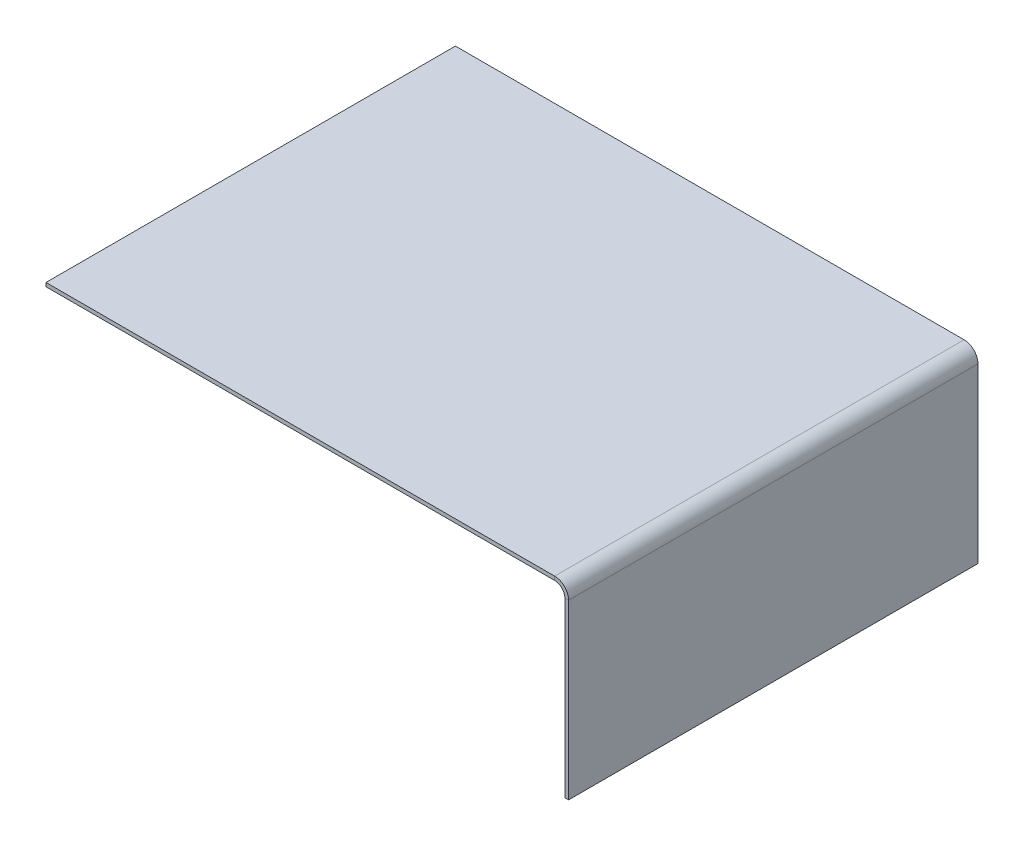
ISO-10303-21;
HEADER;
FILE_DESCRIPTION(('STEP AP214'),'2;1');
FILE_NAME('part.step','',(''),(''),'','','');
FILE_SCHEMA(('AUTOMOTIVE_DESIGN { 1 0 10303 214 1 1 1 1 }'));
ENDSEC;
DATA;
#1=APPLICATION_CONTEXT('core data for automotive mechanical design processes');
#2=APPLICATION_PROTOCOL_DEFINITION('international standard','automotive_design',2000,#1);
#3=PRODUCT_CONTEXT('',#1,'mechanical');
#4=PRODUCT('Part','Part','',(#3));
#5=PRODUCT_RELATED_PRODUCT_CATEGORY('part','',(#4));
#6=PRODUCT_DEFINITION_FORMATION('','',#4);
#7=PRODUCT_DEFINITION_CONTEXT('part definition',#1,'design');
#8=PRODUCT_DEFINITION('design','',#6,#7);
#9=PRODUCT_DEFINITION_SHAPE('','',#8);
#10=(LENGTH_UNIT() NAMED_UNIT(*) SI_UNIT(.MILLI.,.METRE.));
#11=(NAMED_UNIT(*) PLANE_ANGLE_UNIT() SI_UNIT($,.RADIAN.));
#12=(NAMED_UNIT(*) SI_UNIT($,.STERADIAN.) SOLID_ANGLE_UNIT());
#13=UNCERTAINTY_MEASURE_WITH_UNIT(LENGTH_MEASURE(1.E-05),#10,'distance_accuracy_value','');
#14=(GEOMETRIC_REPRESENTATION_CONTEXT(3) GLOBAL_UNCERTAINTY_ASSIGNED_CONTEXT((#13)) GLOBAL_UNIT_ASSIGNED_CONTEXT((#10,
#11,#12)) REPRESENTATION_CONTEXT('',''));
#15=CARTESIAN_POINT('',(0.,0.,0.));
#16=DIRECTION('',(0.,0.,1.));
#17=DIRECTION('',(1.,0.,0.));
#18=AXIS2_PLACEMENT_3D('',#15,#16,#17);
#19=CARTESIAN_POINT('',(100.,-2.7366,0.));
#20=DIRECTION('',(0.,0.,-1.));
#21=DIRECTION('',(-1.,0.,0.));
#22=AXIS2_PLACEMENT_3D('',#19,#20,#21);
#23=PLANE('',#22);
#24=DIRECTION('',(1.,0.,0.));
#25=VECTOR('',#24,1.);
#26=CARTESIAN_POINT('',(102.7366,-2.73659999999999,0.));
#27=LINE('',#26,#25);
#28=CARTESIAN_POINT('',(102.,-2.73659999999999,0.));
#29=VERTEX_POINT('',#28);
#30=CARTESIAN_POINT('',(102.7366,-2.73659999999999,0.));
#31=VERTEX_POINT('',#30);
#32=EDGE_CURVE('E138',#29,#31,#27,.T.);
#33=ORIENTED_EDGE('',*,*,#32,.F.);
#34=CARTESIAN_POINT('',(100.,-2.7366,0.));
#35=DIRECTION('',(0.,0.,1.));
#36=DIRECTION('',(1.,0.,0.));
#37=AXIS2_PLACEMENT_3D('',#34,#35,#36);
#38=CIRCLE('',#37,1.99999999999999);
#39=CARTESIAN_POINT('',(100.,-0.736600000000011,0.));
#40=VERTEX_POINT('',#39);
#41=EDGE_CURVE('E98',#40,#29,#38,.F.);
#42=ORIENTED_EDGE('',*,*,#41,.F.);
#43=DIRECTION('',(0.,-1.,0.));
#44=VECTOR('',#43,1.);
#45=CARTESIAN_POINT('',(100.,0.,0.));
#46=LINE('',#45,#44);
#47=CARTESIAN_POINT('',(100.,0.,0.));
#48=VERTEX_POINT('',#47);
#49=EDGE_CURVE('E144',#48,#40,#46,.T.);
#50=ORIENTED_EDGE('',*,*,#49,.F.);
#51=CARTESIAN_POINT('',(100.,-2.7366,0.));
#52=DIRECTION('',(0.,0.,1.));
#53=DIRECTION('',(1.,0.,0.));
#54=AXIS2_PLACEMENT_3D('',#51,#52,#53);
#55=CIRCLE('',#54,2.73659999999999);
#56=EDGE_CURVE('E11',#48,#31,#55,.F.);
#57=ORIENTED_EDGE('',*,*,#56,.T.);
#58=EDGE_LOOP('',(#33,#42,#50,#57));
#59=FACE_BOUND('',#58,.T.);
#60=ADVANCED_FACE('F34',(#59),#23,.T.);
#61=CARTESIAN_POINT('',(100.,-2.7366,80.4910809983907));
#62=DIRECTION('',(0.,0.,-1.));
#63=DIRECTION('',(-1.,0.,0.));
#64=AXIS2_PLACEMENT_3D('',#61,#62,#63);
#65=PLANE('',#64);
#66=CARTESIAN_POINT('',(100.,-2.7366,80.4910809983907));
#67=DIRECTION('',(0.,0.,1.));
#68=DIRECTION('',(1.,0.,0.));
#69=AXIS2_PLACEMENT_3D('',#66,#67,#68);
#70=CIRCLE('',#69,1.99999999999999);
#71=CARTESIAN_POINT('',(102.,-2.73659999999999,80.4910809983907));
#72=VERTEX_POINT('',#71);
#73=CARTESIAN_POINT('',(100.,-0.736600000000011,80.4910809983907));
#74=VERTEX_POINT('',#73);
#75=EDGE_CURVE('E103',#72,#74,#70,.T.);
#76=ORIENTED_EDGE('',*,*,#75,.F.);
#77=DIRECTION('',(1.,0.,0.));
#78=VECTOR('',#77,1.);
#79=CARTESIAN_POINT('',(102.,-2.73659999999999,80.4910809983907));
#80=LINE('',#79,#78);
#81=CARTESIAN_POINT('',(102.7366,-2.73659999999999,80.4910809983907));
#82=VERTEX_POINT('',#81);
#83=EDGE_CURVE('E101',#72,#82,#80,.T.);
#84=ORIENTED_EDGE('',*,*,#83,.T.);
#85=CARTESIAN_POINT('',(100.,-2.7366,80.4910809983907));
#86=DIRECTION('',(0.,0.,1.));
#87=DIRECTION('',(1.,0.,0.));
#88=AXIS2_PLACEMENT_3D('',#85,#86,#87);
#89=CIRCLE('',#88,2.73659999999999);
#90=CARTESIAN_POINT('',(100.,0.,80.4910809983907));
#91=VERTEX_POINT('',#90);
#92=EDGE_CURVE('E38',#82,#91,#89,.T.);
#93=ORIENTED_EDGE('',*,*,#92,.T.);
#94=DIRECTION('',(0.,-1.,0.));
#95=VECTOR('',#94,1.);
#96=CARTESIAN_POINT('',(100.,0.,80.4910809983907));
#97=LINE('',#96,#95);
#98=EDGE_CURVE('E156',#91,#74,#97,.T.);
#99=ORIENTED_EDGE('',*,*,#98,.T.);
#100=EDGE_LOOP('',(#76,#84,#93,#99));
#101=FACE_BOUND('',#100,.T.);
#102=ADVANCED_FACE('F36',(#101),#65,.F.);
#103=CARTESIAN_POINT('',(100.,-2.7366,80.4910809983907));
#104=DIRECTION('',(0.,0.,1.));
#105=DIRECTION('',(1.,0.,0.));
#106=AXIS2_PLACEMENT_3D('',#103,#104,#105);
#107=CYLINDRICAL_SURFACE('',#106,2.73659999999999);
#108=DIRECTION('',(0.,0.,-1.));
#109=VECTOR('',#108,1.);
#110=CARTESIAN_POINT('',(100.,0.,80.4910809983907));
#111=LINE('',#110,#109);
#112=EDGE_CURVE('E49',#91,#48,#111,.T.);
#113=ORIENTED_EDGE('',*,*,#112,.F.);
#114=ORIENTED_EDGE('',*,*,#92,.F.);
#115=DIRECTION('',(0.,0.,1.));
#116=VECTOR('',#115,1.);
#117=CARTESIAN_POINT('',(102.7366,-2.73659999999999,80.4910809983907));
#118=LINE('',#117,#116);
#119=EDGE_CURVE('E54',#31,#82,#118,.T.);
#120=ORIENTED_EDGE('',*,*,#119,.F.);
#121=ORIENTED_EDGE('',*,*,#56,.F.);
#122=EDGE_LOOP('',(#113,#114,#120,#121));
#123=FACE_BOUND('',#122,.T.);
#124=ADVANCED_FACE('F95',(#123),#107,.T.);
#125=CARTESIAN_POINT('',(100.,-2.7366,80.4910809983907));
#126=DIRECTION('',(0.,0.,1.));
#127=DIRECTION('',(1.,0.,0.));
#128=AXIS2_PLACEMENT_3D('',#125,#126,#127);
#129=CYLINDRICAL_SURFACE('',#128,1.99999999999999);
#130=DIRECTION('',(0.,0.,-1.));
#131=VECTOR('',#130,1.);
#132=CARTESIAN_POINT('',(100.,-0.7366,80.4910809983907));
#133=LINE('',#132,#131);
#134=EDGE_CURVE('E169',#74,#40,#133,.T.);
#135=ORIENTED_EDGE('',*,*,#134,.T.);
#136=ORIENTED_EDGE('',*,*,#41,.T.);
#137=DIRECTION('',(0.,0.,-1.));
#138=VECTOR('',#137,1.);
#139=CARTESIAN_POINT('',(102.,-2.73659999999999,0.));
#140=LINE('',#139,#138);
#141=EDGE_CURVE('E108',#29,#72,#140,.F.);
#142=ORIENTED_EDGE('',*,*,#141,.T.);
#143=ORIENTED_EDGE('',*,*,#75,.T.);
#144=EDGE_LOOP('',(#135,#136,#142,#143));
#145=FACE_BOUND('',#144,.T.);
#146=ADVANCED_FACE('F174',(#145),#129,.F.);
#147=CARTESIAN_POINT('',(0.,-0.7366,80.4910809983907));
#148=DIRECTION('',(0.,1.,0.));
#149=DIRECTION('',(0.,0.,1.));
#150=AXIS2_PLACEMENT_3D('',#147,#148,#149);
#151=PLANE('',#150);
#152=DIRECTION('',(1.,0.,0.));
#153=VECTOR('',#152,1.);
#154=CARTESIAN_POINT('',(0.,-0.7366,0.));
#155=LINE('',#154,#153);
#156=CARTESIAN_POINT('',(0.,-0.7366,0.));
#157=VERTEX_POINT('',#156);
#158=EDGE_CURVE('E141',#157,#40,#155,.T.);
#159=ORIENTED_EDGE('',*,*,#158,.T.);
#160=ORIENTED_EDGE('',*,*,#134,.F.);
#161=DIRECTION('',(1.,0.,0.));
#162=VECTOR('',#161,1.);
#163=CARTESIAN_POINT('',(0.,-0.7366,80.4910809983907));
#164=LINE('',#163,#162);
#165=CARTESIAN_POINT('',(0.,-0.7366,80.4910809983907));
#166=VERTEX_POINT('',#165);
#167=EDGE_CURVE('E153',#166,#74,#164,.T.);
#168=ORIENTED_EDGE('',*,*,#167,.F.);
#169=DIRECTION('',(0.,0.,-1.));
#170=VECTOR('',#169,1.);
#171=CARTESIAN_POINT('',(0.,-0.7366,80.4910809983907));
#172=LINE('',#171,#170);
#173=EDGE_CURVE('E164',#166,#157,#172,.T.);
#174=ORIENTED_EDGE('',*,*,#173,.T.);
#175=EDGE_LOOP('',(#159,#160,#168,#174));
#176=FACE_BOUND('',#175,.T.);
#177=ADVANCED_FACE('F184',(#176),#151,.F.);
#178=CARTESIAN_POINT('',(0.,0.,80.4910809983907));
#179=DIRECTION('',(0.,1.,0.));
#180=DIRECTION('',(0.,0.,1.));
#181=AXIS2_PLACEMENT_3D('',#178,#179,#180);
#182=PLANE('',#181);
#183=DIRECTION('',(1.,0.,0.));
#184=VECTOR('',#183,1.);
#185=CARTESIAN_POINT('',(0.,0.,0.));
#186=LINE('',#185,#184);
#187=CARTESIAN_POINT('',(0.,0.,0.));
#188=VERTEX_POINT('',#187);
#189=EDGE_CURVE('E147',#188,#48,#186,.T.);
#190=ORIENTED_EDGE('',*,*,#189,.F.);
#191=DIRECTION('',(0.,0.,-1.));
#192=VECTOR('',#191,1.);
#193=CARTESIAN_POINT('',(0.,0.,80.4910809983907));
#194=LINE('',#193,#192);
#195=CARTESIAN_POINT('',(0.,0.,80.4910809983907));
#196=VERTEX_POINT('',#195);
#197=EDGE_CURVE('E166',#196,#188,#194,.T.);
#198=ORIENTED_EDGE('',*,*,#197,.F.);
#199=DIRECTION('',(1.,0.,0.));
#200=VECTOR('',#199,1.);
#201=CARTESIAN_POINT('',(0.,0.,80.4910809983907));
#202=LINE('',#201,#200);
#203=EDGE_CURVE('E158',#196,#91,#202,.T.);
#204=ORIENTED_EDGE('',*,*,#203,.T.);
#205=ORIENTED_EDGE('',*,*,#112,.T.);
#206=EDGE_LOOP('',(#190,#198,#204,#205));
#207=FACE_BOUND('',#206,.T.);
#208=ADVANCED_FACE('F193',(#207),#182,.T.);
#209=CARTESIAN_POINT('',(0.,-0.7366,80.4910809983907));
#210=DIRECTION('',(-1.,0.,0.));
#211=DIRECTION('',(0.,0.,1.));
#212=AXIS2_PLACEMENT_3D('',#209,#210,#211);
#213=PLANE('',#212);
#214=DIRECTION('',(0.,1.,0.));
#215=VECTOR('',#214,1.);
#216=CARTESIAN_POINT('',(0.,-0.7366,0.));
#217=LINE('',#216,#215);
#218=EDGE_CURVE('E150',#157,#188,#217,.T.);
#219=ORIENTED_EDGE('',*,*,#218,.F.);
#220=ORIENTED_EDGE('',*,*,#173,.F.);
#221=DIRECTION('',(0.,1.,0.));
#222=VECTOR('',#221,1.);
#223=CARTESIAN_POINT('',(0.,-0.7366,80.4910809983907));
#224=LINE('',#223,#222);
#225=EDGE_CURVE('E161',#166,#196,#224,.T.);
#226=ORIENTED_EDGE('',*,*,#225,.T.);
#227=ORIENTED_EDGE('',*,*,#197,.T.);
#228=EDGE_LOOP('',(#219,#220,#226,#227));
#229=FACE_BOUND('',#228,.T.);
#230=ADVANCED_FACE('F195',(#229),#213,.T.);
#231=CARTESIAN_POINT('',(100.,-0.7366,80.4910809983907));
#232=DIRECTION('',(0.,0.,-1.));
#233=DIRECTION('',(-1.,0.,0.));
#234=AXIS2_PLACEMENT_3D('',#231,#232,#233);
#235=PLANE('',#234);
#236=ORIENTED_EDGE('',*,*,#167,.T.);
#237=ORIENTED_EDGE('',*,*,#98,.F.);
#238=ORIENTED_EDGE('',*,*,#203,.F.);
#239=ORIENTED_EDGE('',*,*,#225,.F.);
#240=EDGE_LOOP('',(#236,#237,#238,#239));
#241=FACE_BOUND('',#240,.T.);
#242=ADVANCED_FACE('F181',(#241),#235,.F.);
#243=CARTESIAN_POINT('',(100.,-0.7366,0.));
#244=DIRECTION('',(0.,0.,-1.));
#245=DIRECTION('',(-1.,0.,0.));
#246=AXIS2_PLACEMENT_3D('',#243,#244,#245);
#247=PLANE('',#246);
#248=ORIENTED_EDGE('',*,*,#158,.F.);
#249=ORIENTED_EDGE('',*,*,#218,.T.);
#250=ORIENTED_EDGE('',*,*,#189,.T.);
#251=ORIENTED_EDGE('',*,*,#49,.T.);
#252=EDGE_LOOP('',(#248,#249,#250,#251));
#253=FACE_BOUND('',#252,.T.);
#254=ADVANCED_FACE('F189',(#253),#247,.T.);
#255=CARTESIAN_POINT('',(102.7366,-0.736599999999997,80.4910809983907));
#256=DIRECTION('',(0.,0.,1.));
#257=DIRECTION('',(1.,0.,0.));
#258=AXIS2_PLACEMENT_3D('',#255,#256,#257);
#259=PLANE('',#258);
#260=DIRECTION('',(0.,1.,0.));
#261=VECTOR('',#260,1.);
#262=CARTESIAN_POINT('',(102.7366,-0.736599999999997,80.4910809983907));
#263=LINE('',#262,#261);
#264=CARTESIAN_POINT('',(102.7366,-36.7366,80.4910809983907));
#265=VERTEX_POINT('',#264);
#266=EDGE_CURVE('E115',#265,#82,#263,.T.);
#267=ORIENTED_EDGE('',*,*,#266,.T.);
#268=ORIENTED_EDGE('',*,*,#83,.F.);
#269=DIRECTION('',(0.,-1.,0.));
#270=VECTOR('',#269,1.);
#271=CARTESIAN_POINT('',(102.,-0.7366,80.4910809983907));
#272=LINE('',#271,#270);
#273=CARTESIAN_POINT('',(102.,-36.7366,80.4910809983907));
#274=VERTEX_POINT('',#273);
#275=EDGE_CURVE('E131',#274,#72,#272,.F.);
#276=ORIENTED_EDGE('',*,*,#275,.F.);
#277=DIRECTION('',(-1.,0.,0.));
#278=VECTOR('',#277,1.);
#279=CARTESIAN_POINT('',(102.7366,-36.7366,80.4910809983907));
#280=LINE('',#279,#278);
#281=EDGE_CURVE('E120',#265,#274,#280,.T.);
#282=ORIENTED_EDGE('',*,*,#281,.F.);
#283=EDGE_LOOP('',(#267,#268,#276,#282));
#284=FACE_BOUND('',#283,.T.);
#285=ADVANCED_FACE('F119',(#284),#259,.T.);
#286=CARTESIAN_POINT('',(102.7366,-36.7366,0.));
#287=DIRECTION('',(0.,0.,-1.));
#288=DIRECTION('',(-1.,0.,0.));
#289=AXIS2_PLACEMENT_3D('',#286,#287,#288);
#290=PLANE('',#289);
#291=DIRECTION('',(0.,1.,0.));
#292=VECTOR('',#291,1.);
#293=CARTESIAN_POINT('',(102.,-0.7366,0.));
#294=LINE('',#293,#292);
#295=CARTESIAN_POINT('',(102.,-36.7366,0.));
#296=VERTEX_POINT('',#295);
#297=EDGE_CURVE('E117',#29,#296,#294,.F.);
#298=ORIENTED_EDGE('',*,*,#297,.F.);
#299=ORIENTED_EDGE('',*,*,#32,.T.);
#300=DIRECTION('',(0.,-1.,0.));
#301=VECTOR('',#300,1.);
#302=CARTESIAN_POINT('',(102.7366,-36.7366,0.));
#303=LINE('',#302,#301);
#304=CARTESIAN_POINT('',(102.7366,-36.7366,0.));
#305=VERTEX_POINT('',#304);
#306=EDGE_CURVE('E116',#31,#305,#303,.T.);
#307=ORIENTED_EDGE('',*,*,#306,.T.);
#308=DIRECTION('',(-1.,0.,0.));
#309=VECTOR('',#308,1.);
#310=CARTESIAN_POINT('',(102.7366,-36.7366,0.));
#311=LINE('',#310,#309);
#312=EDGE_CURVE('E122',#305,#296,#311,.T.);
#313=ORIENTED_EDGE('',*,*,#312,.T.);
#314=EDGE_LOOP('',(#298,#299,#307,#313));
#315=FACE_BOUND('',#314,.T.);
#316=ADVANCED_FACE('F256',(#315),#290,.T.);
#317=CARTESIAN_POINT('',(102.7366,-0.736599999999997,80.4910809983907));
#318=DIRECTION('',(1.,0.,0.));
#319=DIRECTION('',(0.,1.,0.));
#320=AXIS2_PLACEMENT_3D('',#317,#318,#319);
#321=PLANE('',#320);
#322=ORIENTED_EDGE('',*,*,#306,.F.);
#323=ORIENTED_EDGE('',*,*,#119,.T.);
#324=ORIENTED_EDGE('',*,*,#266,.F.);
#325=DIRECTION('',(0.,0.,1.));
#326=VECTOR('',#325,1.);
#327=CARTESIAN_POINT('',(102.7366,-36.7366,80.4910809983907));
#328=LINE('',#327,#326);
#329=EDGE_CURVE('E123',#305,#265,#328,.T.);
#330=ORIENTED_EDGE('',*,*,#329,.F.);
#331=EDGE_LOOP('',(#322,#323,#324,#330));
#332=FACE_BOUND('',#331,.T.);
#333=ADVANCED_FACE('F113',(#332),#321,.T.);
#334=CARTESIAN_POINT('',(102.,-0.7366,80.4910809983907));
#335=DIRECTION('',(1.,0.,0.));
#336=DIRECTION('',(0.,1.,0.));
#337=AXIS2_PLACEMENT_3D('',#334,#335,#336);
#338=PLANE('',#337);
#339=ORIENTED_EDGE('',*,*,#141,.F.);
#340=ORIENTED_EDGE('',*,*,#297,.T.);
#341=DIRECTION('',(0.,0.,-1.));
#342=VECTOR('',#341,1.);
#343=CARTESIAN_POINT('',(102.,-36.7366,80.4910809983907));
#344=LINE('',#343,#342);
#345=EDGE_CURVE('E133',#296,#274,#344,.F.);
#346=ORIENTED_EDGE('',*,*,#345,.T.);
#347=ORIENTED_EDGE('',*,*,#275,.T.);
#348=EDGE_LOOP('',(#339,#340,#346,#347));
#349=FACE_BOUND('',#348,.T.);
#350=ADVANCED_FACE('F277',(#349),#338,.F.);
#351=CARTESIAN_POINT('',(102.7366,-36.7366,80.4910809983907));
#352=DIRECTION('',(0.,-1.,0.));
#353=DIRECTION('',(1.,0.,0.));
#354=AXIS2_PLACEMENT_3D('',#351,#352,#353);
#355=PLANE('',#354);
#356=ORIENTED_EDGE('',*,*,#345,.F.);
#357=ORIENTED_EDGE('',*,*,#312,.F.);
#358=ORIENTED_EDGE('',*,*,#329,.T.);
#359=ORIENTED_EDGE('',*,*,#281,.T.);
#360=EDGE_LOOP('',(#356,#357,#358,#359));
#361=FACE_BOUND('',#360,.T.);
#362=ADVANCED_FACE('F287',(#361),#355,.T.);
#363=CLOSED_SHELL('',(#60,#102,#124,#146,#177,#208,#230,#242,#254,#285,#316,#333,#350,#362));
#364=MANIFOLD_SOLID_BREP('B2',#363);
#365=ADVANCED_BREP_SHAPE_REPRESENTATION('',(#18,#364),#14);
#366=SHAPE_DEFINITION_REPRESENTATION(#9,#365);
ENDSEC;
END-ISO-10303-21;
